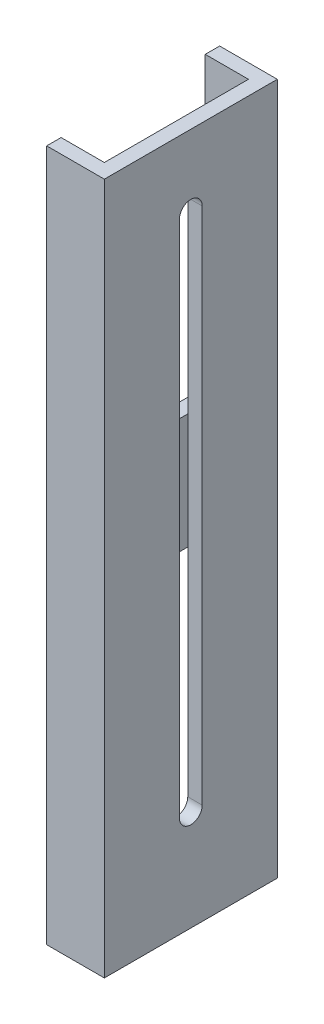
from build123d import *

# Parameters (mm, degrees)
BOSS_EXTRUDE1_DEPTH = 76.2
CUT_EXTRUDE1_DEPTH  = 152.4
BOSS_EXTRUDE2_REACH = 86.779
SKETCH3_W           = 3.175
SKETCH3_H           = 25.4


with BuildPart() as part:
    # Sketch1 → Boss-Extrude1 (new, symmetric)
    with BuildSketch(Plane(origin=(0, 0, 0), x_dir=(-1, 0, 0), z_dir=(0, 1, 0))):
        Polygon((0, -19.05), (0, 19.05), (12.7, 19.05), (12.7, 15.875), (3.175, 15.875), (3.175, -15.875), (12.7, -15.875), (12.7, -19.05), align=None)
    extrude(amount=BOSS_EXTRUDE1_DEPTH, both=True)

    # Sketch2 → Cut-Extrude1 (cut)
    with BuildSketch(Plane(origin=(-3.175, 0, 0), x_dir=(0, -1, 0), z_dir=(-1, 0, 0))):
        with BuildLine():
            Line((-60.309011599, 2.499995), (53.990988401, 2.499995))
            ThreePointArc((53.990988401, 2.499995), (56.490983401, 0), (53.990988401, -2.499995))
            Line((53.990988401, -2.499995), (-60.309011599, -2.499995))
            ThreePointArc((-60.309011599, -2.499995), (-62.809006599, 0), (-60.309011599, 2.499995))
        make_face()
    extrude(amount=-CUT_EXTRUDE1_DEPTH, mode=Mode.SUBTRACT)

    # Sketch3 → Boss-Extrude2 (add, up to next)
    with BuildSketch(Plane(origin=(0, 0, 15.875), x_dir=(1, 0, 0), z_dir=(0, 0, -1)), mode=Mode.PRIVATE) as boss_extrude2_sk1:
        with Locations((-11.1125, 0)):
            Rectangle(SKETCH3_W, SKETCH3_H)
    boss_extrude2_tool1 = extrude(boss_extrude2_sk1.sketch, amount=BOSS_EXTRUDE2_REACH, mode=Mode.PRIVATE) - part.part
    add(boss_extrude2_tool1.solids().sort_by_distance((-11.1125, 0, 15.875))[0])


solid = part.part
